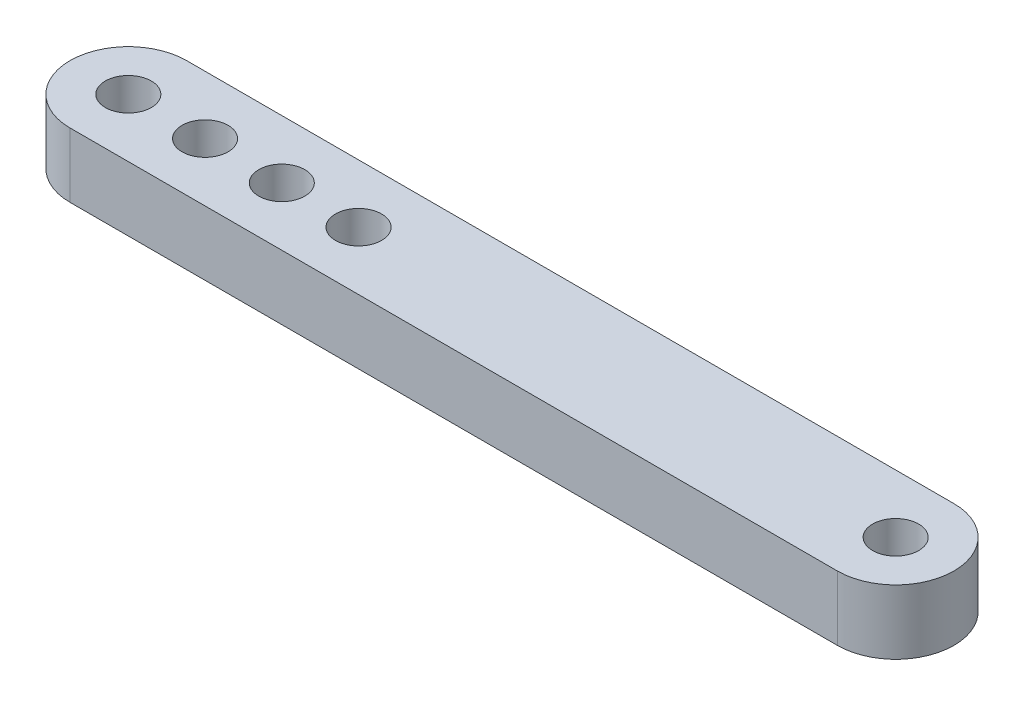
from build123d import *

# Parameters (mm, degrees)
SKETCH1_R           = 1.5
BOSS_EXTRUDE1_DEPTH = 4.2


with BuildPart() as part:
    # Sketch1 → Boss-Extrude1 (new body)
    with BuildSketch(Plane(origin=(0, 0, 0), x_dir=(1, 0, 0), z_dir=(0, 1, 0))):
        with BuildLine():
            Line((25, 3.8), (-25, 3.8))
            ThreePointArc((-25, 3.8), (-28.8, 0), (-25, -3.8))
            Line((-25, -3.8), (25, -3.8))
            ThreePointArc((25, -3.8), (28.8, 0), (25, 3.8))
        make_face()
        with Locations(Location((-20, 0, 0), (0, 0, 270))):
            Circle(SKETCH1_R, mode=Mode.SUBTRACT)
        with Locations(Location((25, 0, 0), (0, 0, 270))):
            Circle(SKETCH1_R, mode=Mode.SUBTRACT)
        with Locations(Location((-10, 0, 0), (0, 0, 270))):
            Circle(SKETCH1_R, mode=Mode.SUBTRACT)
        with Locations(Location((-15, 0, 0), (0, 0, 270))):
            Circle(SKETCH1_R, mode=Mode.SUBTRACT)
        with Locations(Location((-25, 0, 0), (0, 0, 270))):
            Circle(SKETCH1_R, mode=Mode.SUBTRACT)
    extrude(amount=BOSS_EXTRUDE1_DEPTH)


solid = part.part
